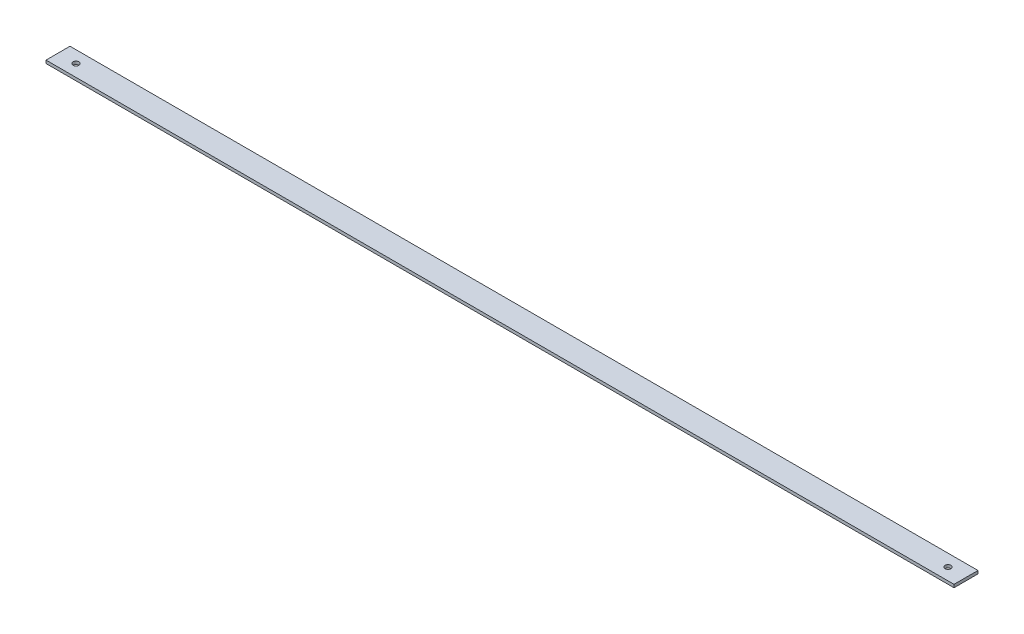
from build123d import *

# Parameters (mm, degrees)
SKETCH1_W           = 961.39
SKETCH1_H           = 25.4
BOSS_EXTRUDE1_DEPTH = 3.175
SKETCH2_R           = 3.175
CUT_EXTRUDE1_DEPTH  = 481.873219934


with BuildPart() as part:
    # Sketch1 → Boss-Extrude1 (new body)
    with BuildSketch(Plane(origin=(0, 0, 0), x_dir=(1, 0, 0), z_dir=(0, 1, 0))):
        Rectangle(SKETCH1_W, SKETCH1_H)
    extrude(amount=BOSS_EXTRUDE1_DEPTH)

    # Sketch2 → Cut-Extrude1 (cut, through all)
    with BuildSketch(Plane(origin=(0, 3.175, 0), x_dir=(1, 0, 0), z_dir=(0, 1, 0))):
        with Locations(Location((461.645, 0, 0), (0, 0, 270))):
            Circle(SKETCH2_R)
        with Locations(Location((-461.645, 0, 0), (0, 0, 270))):
            Circle(SKETCH2_R)
    extrude(amount=-CUT_EXTRUDE1_DEPTH, mode=Mode.SUBTRACT)


solid = part.part
